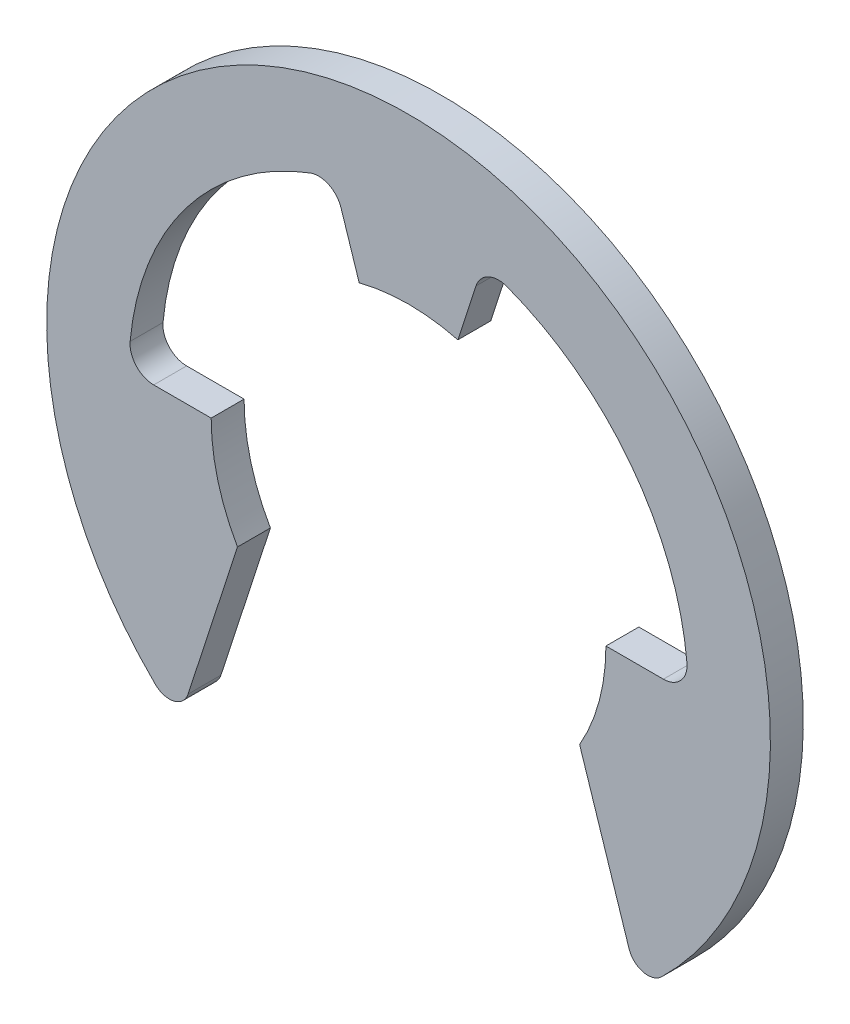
from build123d import *

# Parameters (mm, degrees)
BASEBODY_DEPTH = 2
FILLET1_R      = 1.44


with BuildPart() as part:
    # BodySke → BaseBody (new body)
    with BuildSketch(Plane.XY):
        with BuildLine():
            Line((10.4, -5.986651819), (13.405825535, -15.237631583))
            ThreePointArc((13.405825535, -15.237631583), (14.260621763, -16.032115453), (15.38634874, -15.724511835))
            ThreePointArc((15.38634874, -15.724511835), (0, 22), (-15.38634874, -15.724511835))
            ThreePointArc((-15.38634874, -15.724511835), (-14.260621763, -16.032115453), (-13.405825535, -15.237631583))
            Line((-13.405825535, -15.237631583), (-10.4, -5.986651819))
            ThreePointArc((-10.4, -5.986651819), (-11.593101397, -3.098386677), (-12, 0))
            Line((-12, 0), (-17, 0))
            ThreePointArc((-17, 0), (-13.533320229, 10.288306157), (-4.547147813, 16.380581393))
            Line((-4.547147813, 16.380581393), (-3, 11.618950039))
            ThreePointArc((-3, 11.618950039), (0, 12), (3, 11.618950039))
            Line((3, 11.618950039), (4.547147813, 16.380581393))
            ThreePointArc((4.547147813, 16.380581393), (13.533320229, 10.288306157), (17, 0))
            Line((17, 0), (12, 0))
            ThreePointArc((12, 0), (11.593101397, -3.098386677), (10.4, -5.986651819))
        make_face()
    extrude(amount=BASEBODY_DEPTH)

    # Fillet1
    fillet1_edges = [part.edges().sort_by_distance(p)[0] for p in [
        (17, 0, 1),
        (4.547147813, 16.380581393, 1),
        (-4.547147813, 16.380581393, 1),
        (-17, 0, 1),
    ]]
    fillet(fillet1_edges, radius=FILLET1_R)


solid = part.part
